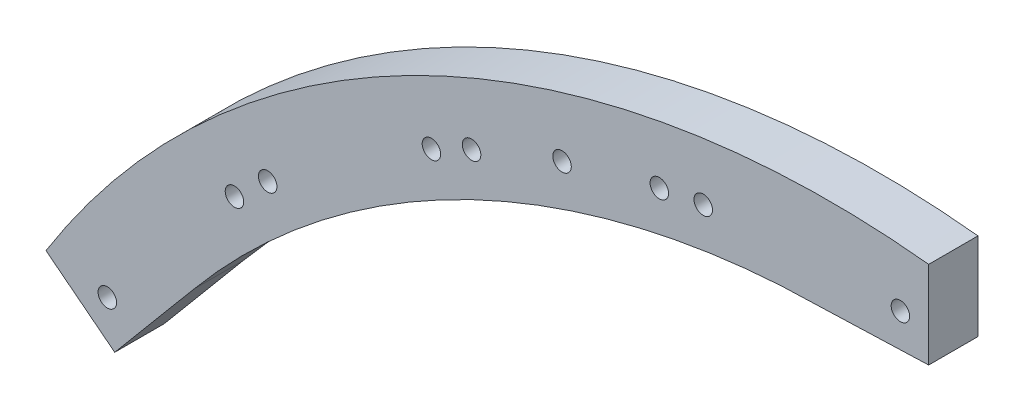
ISO-10303-21;
HEADER;
FILE_DESCRIPTION(('STEP AP214'),'2;1');
FILE_NAME('part.step','',(''),(''),'','','');
FILE_SCHEMA(('AUTOMOTIVE_DESIGN { 1 0 10303 214 1 1 1 1 }'));
ENDSEC;
DATA;
#1=APPLICATION_CONTEXT('core data for automotive mechanical design processes');
#2=APPLICATION_PROTOCOL_DEFINITION('international standard','automotive_design',2000,#1);
#3=PRODUCT_CONTEXT('',#1,'mechanical');
#4=PRODUCT('Part','Part','',(#3));
#5=PRODUCT_RELATED_PRODUCT_CATEGORY('part','',(#4));
#6=PRODUCT_DEFINITION_FORMATION('','',#4);
#7=PRODUCT_DEFINITION_CONTEXT('part definition',#1,'design');
#8=PRODUCT_DEFINITION('design','',#6,#7);
#9=PRODUCT_DEFINITION_SHAPE('','',#8);
#10=(LENGTH_UNIT() NAMED_UNIT(*) SI_UNIT(.MILLI.,.METRE.));
#11=(NAMED_UNIT(*) PLANE_ANGLE_UNIT() SI_UNIT($,.RADIAN.));
#12=(NAMED_UNIT(*) SI_UNIT($,.STERADIAN.) SOLID_ANGLE_UNIT());
#13=UNCERTAINTY_MEASURE_WITH_UNIT(LENGTH_MEASURE(1.E-05),#10,'distance_accuracy_value','');
#14=(GEOMETRIC_REPRESENTATION_CONTEXT(3) GLOBAL_UNCERTAINTY_ASSIGNED_CONTEXT((#13)) GLOBAL_UNIT_ASSIGNED_CONTEXT((#10,
#11,#12)) REPRESENTATION_CONTEXT('',''));
#15=CARTESIAN_POINT('',(0.,0.,0.));
#16=DIRECTION('',(0.,0.,1.));
#17=DIRECTION('',(1.,0.,0.));
#18=AXIS2_PLACEMENT_3D('',#15,#16,#17);
#19=CARTESIAN_POINT('',(-6.34135024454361,-53.5776344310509,3.175));
#20=DIRECTION('',(0.,0.,-1.));
#21=DIRECTION('',(-1.,0.,0.));
#22=AXIS2_PLACEMENT_3D('',#19,#20,#21);
#23=CYLINDRICAL_SURFACE('',#22,59.5312500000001);
#24=CARTESIAN_POINT('',(-6.34135024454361,-53.5776344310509,0.));
#25=DIRECTION('',(0.,0.,1.));
#26=DIRECTION('',(1.,0.,0.));
#27=AXIS2_PLACEMENT_3D('',#24,#25,#26);
#28=CIRCLE('',#27,59.5312500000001);
#29=CARTESIAN_POINT('',(1.34441069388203E-13,5.61490735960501,0.));
#30=VERTEX_POINT('',#29);
#31=CARTESIAN_POINT('',(-56.8286666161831,-22.0340041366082,0.));
#32=VERTEX_POINT('',#31);
#33=EDGE_CURVE('E121',#30,#32,#28,.T.);
#34=ORIENTED_EDGE('',*,*,#33,.T.);
#35=DIRECTION('',(0.,0.,-1.));
#36=VECTOR('',#35,1.);
#37=CARTESIAN_POINT('',(-56.8286666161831,-22.0340041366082,3.175));
#38=LINE('',#37,#36);
#39=CARTESIAN_POINT('',(-56.8286666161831,-22.0340041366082,3.175));
#40=VERTEX_POINT('',#39);
#41=EDGE_CURVE('E11',#40,#32,#38,.T.);
#42=ORIENTED_EDGE('',*,*,#41,.F.);
#43=CARTESIAN_POINT('',(-6.34135024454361,-53.5776344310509,3.175));
#44=DIRECTION('',(0.,0.,1.));
#45=DIRECTION('',(1.,0.,0.));
#46=AXIS2_PLACEMENT_3D('',#43,#44,#45);
#47=CIRCLE('',#46,59.5312500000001);
#48=CARTESIAN_POINT('',(1.34441069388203E-13,5.61490735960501,3.175));
#49=VERTEX_POINT('',#48);
#50=EDGE_CURVE('E132',#49,#40,#47,.T.);
#51=ORIENTED_EDGE('',*,*,#50,.F.);
#52=DIRECTION('',(0.,0.,-1.));
#53=VECTOR('',#52,1.);
#54=CARTESIAN_POINT('',(1.34441069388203E-13,5.61490735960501,3.175));
#55=LINE('',#54,#53);
#56=EDGE_CURVE('E117',#49,#30,#55,.T.);
#57=ORIENTED_EDGE('',*,*,#56,.T.);
#58=EDGE_LOOP('',(#34,#42,#51,#57));
#59=FACE_BOUND('',#58,.T.);
#60=ADVANCED_FACE('F37',(#59),#23,.T.);
#61=CARTESIAN_POINT('',(-56.8286666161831,-22.0340041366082,3.175));
#62=DIRECTION('',(0.615661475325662,0.788010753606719,0.));
#63=DIRECTION('',(-0.788010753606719,0.615661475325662,0.));
#64=AXIS2_PLACEMENT_3D('',#61,#62,#63);
#65=PLANE('',#64);
#66=DIRECTION('',(0.788010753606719,-0.615661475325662,0.));
#67=VECTOR('',#66,1.);
#68=CARTESIAN_POINT('',(-56.8286666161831,-22.0340041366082,0.));
#69=LINE('',#68,#67);
#70=CARTESIAN_POINT('',(-52.404059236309,-25.4908862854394,0.));
#71=VERTEX_POINT('',#70);
#72=EDGE_CURVE('E124',#32,#71,#69,.T.);
#73=ORIENTED_EDGE('',*,*,#72,.T.);
#74=DIRECTION('',(0.,0.,-1.));
#75=VECTOR('',#74,1.);
#76=CARTESIAN_POINT('',(-52.404059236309,-25.4908862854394,3.175));
#77=LINE('',#76,#75);
#78=CARTESIAN_POINT('',(-52.404059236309,-25.4908862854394,3.175));
#79=VERTEX_POINT('',#78);
#80=EDGE_CURVE('E45',#79,#71,#77,.T.);
#81=ORIENTED_EDGE('',*,*,#80,.F.);
#82=DIRECTION('',(0.788010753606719,-0.615661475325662,0.));
#83=VECTOR('',#82,1.);
#84=CARTESIAN_POINT('',(-56.8286666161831,-22.0340041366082,3.175));
#85=LINE('',#84,#83);
#86=EDGE_CURVE('E90',#40,#79,#85,.T.);
#87=ORIENTED_EDGE('',*,*,#86,.F.);
#88=ORIENTED_EDGE('',*,*,#41,.T.);
#89=EDGE_LOOP('',(#73,#81,#87,#88));
#90=FACE_BOUND('',#89,.T.);
#91=ADVANCED_FACE('F157',(#90),#65,.F.);
#92=CARTESIAN_POINT('',(-52.404059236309,-25.4908862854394,3.175));
#93=DIRECTION('',(-0.766044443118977,0.64278760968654,0.));
#94=DIRECTION('',(-0.64278760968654,-0.766044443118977,0.));
#95=AXIS2_PLACEMENT_3D('',#92,#93,#94);
#96=PLANE('',#95);
#97=DIRECTION('',(0.64278760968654,0.766044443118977,0.));
#98=VECTOR('',#97,1.);
#99=CARTESIAN_POINT('',(-52.404059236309,-25.4908862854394,0.));
#100=LINE('',#99,#98);
#101=CARTESIAN_POINT('',(-47.2988226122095,-19.4067021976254,0.));
#102=VERTEX_POINT('',#101);
#103=EDGE_CURVE('E127',#71,#102,#100,.T.);
#104=ORIENTED_EDGE('',*,*,#103,.T.);
#105=DIRECTION('',(0.,0.,-1.));
#106=VECTOR('',#105,1.);
#107=CARTESIAN_POINT('',(-47.2988226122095,-19.4067021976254,3.175));
#108=LINE('',#107,#106);
#109=CARTESIAN_POINT('',(-47.2988226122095,-19.4067021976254,3.175));
#110=VERTEX_POINT('',#109);
#111=EDGE_CURVE('E112',#110,#102,#108,.T.);
#112=ORIENTED_EDGE('',*,*,#111,.F.);
#113=DIRECTION('',(0.64278760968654,0.766044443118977,0.));
#114=VECTOR('',#113,1.);
#115=CARTESIAN_POINT('',(-52.404059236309,-25.4908862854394,3.175));
#116=LINE('',#115,#114);
#117=EDGE_CURVE('E103',#79,#110,#116,.T.);
#118=ORIENTED_EDGE('',*,*,#117,.F.);
#119=ORIENTED_EDGE('',*,*,#80,.T.);
#120=EDGE_LOOP('',(#104,#112,#118,#119));
#121=FACE_BOUND('',#120,.T.);
#122=ADVANCED_FACE('F138',(#121),#96,.F.);
#123=CARTESIAN_POINT('',(-6.34135024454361,-53.5776344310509,3.175));
#124=DIRECTION('',(0.,0.,-1.));
#125=DIRECTION('',(-1.,0.,0.));
#126=AXIS2_PLACEMENT_3D('',#123,#124,#125);
#127=CYLINDRICAL_SURFACE('',#126,53.3401082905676);
#128=CARTESIAN_POINT('',(-6.34135024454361,-53.5776344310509,0.));
#129=DIRECTION('',(0.,0.,-1.));
#130=DIRECTION('',(1.,0.,0.));
#131=AXIS2_PLACEMENT_3D('',#128,#129,#130);
#132=CIRCLE('',#131,53.3401082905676);
#133=CARTESIAN_POINT('',(-9.525,-0.332620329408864,0.));
#134=VERTEX_POINT('',#133);
#135=EDGE_CURVE('E111',#102,#134,#132,.T.);
#136=ORIENTED_EDGE('',*,*,#135,.T.);
#137=DIRECTION('',(0.,0.,-1.));
#138=VECTOR('',#137,1.);
#139=CARTESIAN_POINT('',(-9.525,-0.332620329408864,3.175));
#140=LINE('',#139,#138);
#141=CARTESIAN_POINT('',(-9.525,-0.332620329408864,3.175));
#142=VERTEX_POINT('',#141);
#143=EDGE_CURVE('E108',#142,#134,#140,.T.);
#144=ORIENTED_EDGE('',*,*,#143,.F.);
#145=CARTESIAN_POINT('',(-6.34135024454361,-53.5776344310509,3.175));
#146=DIRECTION('',(0.,0.,-1.));
#147=DIRECTION('',(1.,0.,0.));
#148=AXIS2_PLACEMENT_3D('',#145,#146,#147);
#149=CIRCLE('',#148,53.3401082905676);
#150=EDGE_CURVE('E97',#110,#142,#149,.T.);
#151=ORIENTED_EDGE('',*,*,#150,.F.);
#152=ORIENTED_EDGE('',*,*,#111,.T.);
#153=EDGE_LOOP('',(#136,#144,#151,#152));
#154=FACE_BOUND('',#153,.T.);
#155=ADVANCED_FACE('F109',(#154),#127,.F.);
#156=CARTESIAN_POINT('',(-9.525,-0.332620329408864,3.175));
#157=DIRECTION('',(-0.0348994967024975,0.999390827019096,0.));
#158=DIRECTION('',(-0.999390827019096,-0.0348994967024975,0.));
#159=AXIS2_PLACEMENT_3D('',#156,#157,#158);
#160=PLANE('',#159);
#161=DIRECTION('',(0.999390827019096,0.0348994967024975,0.));
#162=VECTOR('',#161,1.);
#163=CARTESIAN_POINT('',(-9.525,-0.332620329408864,0.));
#164=LINE('',#163,#162);
#165=CARTESIAN_POINT('',(0.,0.,0.));
#166=VERTEX_POINT('',#165);
#167=EDGE_CURVE('E76',#134,#166,#164,.T.);
#168=ORIENTED_EDGE('',*,*,#167,.T.);
#169=DIRECTION('',(0.,0.,-1.));
#170=VECTOR('',#169,1.);
#171=CARTESIAN_POINT('',(0.,0.,3.175));
#172=LINE('',#171,#170);
#173=CARTESIAN_POINT('',(0.,0.,3.175));
#174=VERTEX_POINT('',#173);
#175=EDGE_CURVE('E113',#174,#166,#172,.T.);
#176=ORIENTED_EDGE('',*,*,#175,.F.);
#177=DIRECTION('',(0.999390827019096,0.0348994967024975,0.));
#178=VECTOR('',#177,1.);
#179=CARTESIAN_POINT('',(-9.525,-0.332620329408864,3.175));
#180=LINE('',#179,#178);
#181=EDGE_CURVE('E101',#142,#174,#180,.T.);
#182=ORIENTED_EDGE('',*,*,#181,.F.);
#183=ORIENTED_EDGE('',*,*,#143,.T.);
#184=EDGE_LOOP('',(#168,#176,#182,#183));
#185=FACE_BOUND('',#184,.T.);
#186=ADVANCED_FACE('F115',(#185),#160,.F.);
#187=CARTESIAN_POINT('',(0.,0.,3.175));
#188=DIRECTION('',(-1.,0.,0.));
#189=DIRECTION('',(0.,-1.,0.));
#190=AXIS2_PLACEMENT_3D('',#187,#188,#189);
#191=PLANE('',#190);
#192=DIRECTION('',(0.,1.,0.));
#193=VECTOR('',#192,1.);
#194=CARTESIAN_POINT('',(0.,0.,0.));
#195=LINE('',#194,#193);
#196=EDGE_CURVE('E82',#166,#30,#195,.T.);
#197=ORIENTED_EDGE('',*,*,#196,.T.);
#198=ORIENTED_EDGE('',*,*,#56,.F.);
#199=DIRECTION('',(0.,1.,0.));
#200=VECTOR('',#199,1.);
#201=CARTESIAN_POINT('',(0.,0.,3.175));
#202=LINE('',#201,#200);
#203=EDGE_CURVE('E53',#174,#49,#202,.T.);
#204=ORIENTED_EDGE('',*,*,#203,.F.);
#205=ORIENTED_EDGE('',*,*,#175,.T.);
#206=EDGE_LOOP('',(#197,#198,#204,#205));
#207=FACE_BOUND('',#206,.T.);
#208=ADVANCED_FACE('F145',(#207),#191,.F.);
#209=CARTESIAN_POINT('',(-6.34135024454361,-53.5776344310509,3.175));
#210=DIRECTION('',(0.,0.,1.));
#211=DIRECTION('',(1.,0.,0.));
#212=AXIS2_PLACEMENT_3D('',#209,#210,#211);
#213=PLANE('',#212);
#214=CARTESIAN_POINT('',(-1.82101837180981,2.1004868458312,3.175));
#215=DIRECTION('',(0.,0.,1.));
#216=DIRECTION('',(1.,0.,0.));
#217=AXIS2_PLACEMENT_3D('',#214,#215,#216);
#218=CIRCLE('',#217,0.595629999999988);
#219=CARTESIAN_POINT('',(-1.22538837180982,2.1004868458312,3.175));
#220=VERTEX_POINT('',#219);
#221=EDGE_CURVE('E311',#220,#220,#218,.T.);
#222=ORIENTED_EDGE('',*,*,#221,.F.);
#223=EDGE_LOOP('',(#222));
#224=FACE_BOUND('',#223,.T.);
#225=CARTESIAN_POINT('',(-14.5142055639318,1.68455547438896,3.175));
#226=DIRECTION('',(0.,0.,1.));
#227=DIRECTION('',(1.,0.,0.));
#228=AXIS2_PLACEMENT_3D('',#225,#226,#227);
#229=CIRCLE('',#228,0.595629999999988);
#230=CARTESIAN_POINT('',(-13.9185755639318,1.68455547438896,3.175));
#231=VERTEX_POINT('',#230);
#232=EDGE_CURVE('E313',#231,#231,#229,.T.);
#233=ORIENTED_EDGE('',*,*,#232,.F.);
#234=EDGE_LOOP('',(#233));
#235=FACE_BOUND('',#234,.T.);
#236=CARTESIAN_POINT('',(-17.3431772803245,1.19200216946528,3.175));
#237=DIRECTION('',(0.,0.,1.));
#238=DIRECTION('',(1.,0.,0.));
#239=AXIS2_PLACEMENT_3D('',#236,#237,#238);
#240=CIRCLE('',#239,0.595629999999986);
#241=CARTESIAN_POINT('',(-16.7475472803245,1.19200216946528,3.175));
#242=VERTEX_POINT('',#241);
#243=EDGE_CURVE('E321',#242,#242,#240,.T.);
#244=ORIENTED_EDGE('',*,*,#243,.F.);
#245=EDGE_LOOP('',(#244));
#246=FACE_BOUND('',#245,.T.);
#247=CARTESIAN_POINT('',(-29.430006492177,-2.70653083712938,3.175));
#248=DIRECTION('',(0.,0.,1.));
#249=DIRECTION('',(1.,0.,0.));
#250=AXIS2_PLACEMENT_3D('',#247,#248,#249);
#251=CIRCLE('',#250,0.595629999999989);
#252=CARTESIAN_POINT('',(-28.834376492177,-2.70653083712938,3.175));
#253=VERTEX_POINT('',#252);
#254=EDGE_CURVE('E327',#253,#253,#251,.T.);
#255=ORIENTED_EDGE('',*,*,#254,.F.);
#256=EDGE_LOOP('',(#255));
#257=FACE_BOUND('',#256,.T.);
#258=CARTESIAN_POINT('',(-32.013622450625,-3.95977506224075,3.175));
#259=DIRECTION('',(0.,0.,1.));
#260=DIRECTION('',(1.,0.,0.));
#261=AXIS2_PLACEMENT_3D('',#258,#259,#260);
#262=CIRCLE('',#261,0.595629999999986);
#263=CARTESIAN_POINT('',(-31.417992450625,-3.95977506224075,3.175));
#264=VERTEX_POINT('',#263);
#265=EDGE_CURVE('E333',#264,#264,#262,.T.);
#266=ORIENTED_EDGE('',*,*,#265,.F.);
#267=EDGE_LOOP('',(#266));
#268=FACE_BOUND('',#267,.T.);
#269=CARTESIAN_POINT('',(-42.5576470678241,-11.0388671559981,3.175));
#270=DIRECTION('',(0.,0.,1.));
#271=DIRECTION('',(1.,0.,0.));
#272=AXIS2_PLACEMENT_3D('',#269,#270,#271);
#273=CIRCLE('',#272,0.595629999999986);
#274=CARTESIAN_POINT('',(-41.9620170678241,-11.0388671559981,3.175));
#275=VERTEX_POINT('',#274);
#276=EDGE_CURVE('E339',#275,#275,#273,.T.);
#277=ORIENTED_EDGE('',*,*,#276,.F.);
#278=EDGE_LOOP('',(#277));
#279=FACE_BOUND('',#278,.T.);
#280=CARTESIAN_POINT('',(-44.6957372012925,-12.9557038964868,3.175));
#281=DIRECTION('',(0.,0.,1.));
#282=DIRECTION('',(1.,0.,0.));
#283=AXIS2_PLACEMENT_3D('',#280,#281,#282);
#284=CIRCLE('',#283,0.595629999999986);
#285=CARTESIAN_POINT('',(-44.1001072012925,-12.9557038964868,3.175));
#286=VERTEX_POINT('',#285);
#287=EDGE_CURVE('E345',#286,#286,#284,.T.);
#288=ORIENTED_EDGE('',*,*,#287,.F.);
#289=EDGE_LOOP('',(#288));
#290=FACE_BOUND('',#289,.T.);
#291=CARTESIAN_POINT('',(-52.8800419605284,-22.6668910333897,3.175));
#292=DIRECTION('',(0.,0.,1.));
#293=DIRECTION('',(1.,0.,0.));
#294=AXIS2_PLACEMENT_3D('',#291,#292,#293);
#295=CIRCLE('',#294,0.595629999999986);
#296=CARTESIAN_POINT('',(-52.2844119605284,-22.6668910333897,3.175));
#297=VERTEX_POINT('',#296);
#298=EDGE_CURVE('E351',#297,#297,#295,.T.);
#299=ORIENTED_EDGE('',*,*,#298,.F.);
#300=EDGE_LOOP('',(#299));
#301=FACE_BOUND('',#300,.T.);
#302=CARTESIAN_POINT('',(-23.6047422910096,-0.446376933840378,3.175));
#303=DIRECTION('',(0.,0.,1.));
#304=DIRECTION('',(1.,0.,0.));
#305=AXIS2_PLACEMENT_3D('',#302,#303,#304);
#306=CIRCLE('',#305,0.595629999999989);
#307=CARTESIAN_POINT('',(-23.0091122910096,-0.446376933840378,3.175));
#308=VERTEX_POINT('',#307);
#309=EDGE_CURVE('E357',#308,#308,#306,.T.);
#310=ORIENTED_EDGE('',*,*,#309,.F.);
#311=EDGE_LOOP('',(#310));
#312=FACE_BOUND('',#311,.T.);
#313=ORIENTED_EDGE('',*,*,#50,.T.);
#314=ORIENTED_EDGE('',*,*,#86,.T.);
#315=ORIENTED_EDGE('',*,*,#117,.T.);
#316=ORIENTED_EDGE('',*,*,#150,.T.);
#317=ORIENTED_EDGE('',*,*,#181,.T.);
#318=ORIENTED_EDGE('',*,*,#203,.T.);
#319=EDGE_LOOP('',(#313,#314,#315,#316,#317,#318));
#320=FACE_BOUND('',#319,.T.);
#321=ADVANCED_FACE('F99',(#224,#235,#246,#257,#268,#279,#290,#301,#312,#320),#213,.T.);
#322=CARTESIAN_POINT('',(-6.34135024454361,-53.5776344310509,0.));
#323=DIRECTION('',(0.,0.,1.));
#324=DIRECTION('',(1.,0.,0.));
#325=AXIS2_PLACEMENT_3D('',#322,#323,#324);
#326=PLANE('',#325);
#327=CARTESIAN_POINT('',(-1.82101837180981,2.1004868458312,0.));
#328=DIRECTION('',(0.,0.,1.));
#329=DIRECTION('',(1.,0.,0.));
#330=AXIS2_PLACEMENT_3D('',#327,#328,#329);
#331=CIRCLE('',#330,0.595629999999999);
#332=CARTESIAN_POINT('',(-1.22538837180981,2.1004868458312,0.));
#333=VERTEX_POINT('',#332);
#334=EDGE_CURVE('E308',#333,#333,#331,.T.);
#335=ORIENTED_EDGE('',*,*,#334,.T.);
#336=EDGE_LOOP('',(#335));
#337=FACE_BOUND('',#336,.T.);
#338=CARTESIAN_POINT('',(-14.5142055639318,1.68455547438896,0.));
#339=DIRECTION('',(0.,0.,1.));
#340=DIRECTION('',(1.,0.,0.));
#341=AXIS2_PLACEMENT_3D('',#338,#339,#340);
#342=CIRCLE('',#341,0.59563);
#343=CARTESIAN_POINT('',(-13.9185755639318,1.68455547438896,0.));
#344=VERTEX_POINT('',#343);
#345=EDGE_CURVE('E318',#344,#344,#342,.T.);
#346=ORIENTED_EDGE('',*,*,#345,.T.);
#347=EDGE_LOOP('',(#346));
#348=FACE_BOUND('',#347,.T.);
#349=CARTESIAN_POINT('',(-17.3431772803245,1.19200216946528,0.));
#350=DIRECTION('',(0.,0.,1.));
#351=DIRECTION('',(1.,0.,0.));
#352=AXIS2_PLACEMENT_3D('',#349,#350,#351);
#353=CIRCLE('',#352,0.59563);
#354=CARTESIAN_POINT('',(-16.7475472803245,1.19200216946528,0.));
#355=VERTEX_POINT('',#354);
#356=EDGE_CURVE('E324',#355,#355,#353,.T.);
#357=ORIENTED_EDGE('',*,*,#356,.T.);
#358=EDGE_LOOP('',(#357));
#359=FACE_BOUND('',#358,.T.);
#360=CARTESIAN_POINT('',(-29.430006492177,-2.70653083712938,0.));
#361=DIRECTION('',(0.,0.,1.));
#362=DIRECTION('',(1.,0.,0.));
#363=AXIS2_PLACEMENT_3D('',#360,#361,#362);
#364=CIRCLE('',#363,0.59563);
#365=CARTESIAN_POINT('',(-28.834376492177,-2.70653083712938,0.));
#366=VERTEX_POINT('',#365);
#367=EDGE_CURVE('E330',#366,#366,#364,.T.);
#368=ORIENTED_EDGE('',*,*,#367,.T.);
#369=EDGE_LOOP('',(#368));
#370=FACE_BOUND('',#369,.T.);
#371=CARTESIAN_POINT('',(-32.013622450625,-3.95977506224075,0.));
#372=DIRECTION('',(0.,0.,1.));
#373=DIRECTION('',(1.,0.,0.));
#374=AXIS2_PLACEMENT_3D('',#371,#372,#373);
#375=CIRCLE('',#374,0.59563);
#376=CARTESIAN_POINT('',(-31.417992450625,-3.95977506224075,0.));
#377=VERTEX_POINT('',#376);
#378=EDGE_CURVE('E336',#377,#377,#375,.T.);
#379=ORIENTED_EDGE('',*,*,#378,.T.);
#380=EDGE_LOOP('',(#379));
#381=FACE_BOUND('',#380,.T.);
#382=CARTESIAN_POINT('',(-42.5576470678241,-11.0388671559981,0.));
#383=DIRECTION('',(0.,0.,1.));
#384=DIRECTION('',(1.,0.,0.));
#385=AXIS2_PLACEMENT_3D('',#382,#383,#384);
#386=CIRCLE('',#385,0.59563);
#387=CARTESIAN_POINT('',(-41.9620170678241,-11.0388671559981,0.));
#388=VERTEX_POINT('',#387);
#389=EDGE_CURVE('E342',#388,#388,#386,.T.);
#390=ORIENTED_EDGE('',*,*,#389,.T.);
#391=EDGE_LOOP('',(#390));
#392=FACE_BOUND('',#391,.T.);
#393=CARTESIAN_POINT('',(-44.6957372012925,-12.9557038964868,0.));
#394=DIRECTION('',(0.,0.,1.));
#395=DIRECTION('',(1.,0.,0.));
#396=AXIS2_PLACEMENT_3D('',#393,#394,#395);
#397=CIRCLE('',#396,0.59563);
#398=CARTESIAN_POINT('',(-44.1001072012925,-12.9557038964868,0.));
#399=VERTEX_POINT('',#398);
#400=EDGE_CURVE('E348',#399,#399,#397,.T.);
#401=ORIENTED_EDGE('',*,*,#400,.T.);
#402=EDGE_LOOP('',(#401));
#403=FACE_BOUND('',#402,.T.);
#404=CARTESIAN_POINT('',(-52.8800419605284,-22.6668910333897,0.));
#405=DIRECTION('',(0.,0.,1.));
#406=DIRECTION('',(1.,0.,0.));
#407=AXIS2_PLACEMENT_3D('',#404,#405,#406);
#408=CIRCLE('',#407,0.59563);
#409=CARTESIAN_POINT('',(-52.2844119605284,-22.6668910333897,0.));
#410=VERTEX_POINT('',#409);
#411=EDGE_CURVE('E354',#410,#410,#408,.T.);
#412=ORIENTED_EDGE('',*,*,#411,.T.);
#413=EDGE_LOOP('',(#412));
#414=FACE_BOUND('',#413,.T.);
#415=CARTESIAN_POINT('',(-23.6047422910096,-0.446376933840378,0.));
#416=DIRECTION('',(0.,0.,1.));
#417=DIRECTION('',(1.,0.,0.));
#418=AXIS2_PLACEMENT_3D('',#415,#416,#417);
#419=CIRCLE('',#418,0.59563);
#420=CARTESIAN_POINT('',(-23.0091122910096,-0.446376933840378,0.));
#421=VERTEX_POINT('',#420);
#422=EDGE_CURVE('E125',#421,#421,#419,.T.);
#423=ORIENTED_EDGE('',*,*,#422,.T.);
#424=EDGE_LOOP('',(#423));
#425=FACE_BOUND('',#424,.T.);
#426=ORIENTED_EDGE('',*,*,#33,.F.);
#427=ORIENTED_EDGE('',*,*,#196,.F.);
#428=ORIENTED_EDGE('',*,*,#167,.F.);
#429=ORIENTED_EDGE('',*,*,#135,.F.);
#430=ORIENTED_EDGE('',*,*,#103,.F.);
#431=ORIENTED_EDGE('',*,*,#72,.F.);
#432=EDGE_LOOP('',(#426,#427,#428,#429,#430,#431));
#433=FACE_BOUND('',#432,.T.);
#434=ADVANCED_FACE('F141',(#337,#348,#359,#370,#381,#392,#403,#414,#425,#433),#326,.F.);
#435=CARTESIAN_POINT('',(-23.6047422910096,-0.446376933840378,3.175));
#436=DIRECTION('',(0.,0.,1.));
#437=DIRECTION('',(1.,0.,0.));
#438=AXIS2_PLACEMENT_3D('',#435,#436,#437);
#439=CYLINDRICAL_SURFACE('',#438,0.595629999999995);
#440=ORIENTED_EDGE('',*,*,#422,.F.);
#441=EDGE_LOOP('',(#440));
#442=FACE_BOUND('',#441,.T.);
#443=ORIENTED_EDGE('',*,*,#309,.T.);
#444=EDGE_LOOP('',(#443));
#445=FACE_BOUND('',#444,.T.);
#446=ADVANCED_FACE('F194',(#442,#445),#439,.F.);
#447=CARTESIAN_POINT('',(-52.8800419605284,-22.6668910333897,3.175));
#448=DIRECTION('',(0.,0.,1.));
#449=DIRECTION('',(1.,0.,0.));
#450=AXIS2_PLACEMENT_3D('',#447,#448,#449);
#451=CYLINDRICAL_SURFACE('',#450,0.595629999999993);
#452=ORIENTED_EDGE('',*,*,#411,.F.);
#453=EDGE_LOOP('',(#452));
#454=FACE_BOUND('',#453,.T.);
#455=ORIENTED_EDGE('',*,*,#298,.T.);
#456=EDGE_LOOP('',(#455));
#457=FACE_BOUND('',#456,.T.);
#458=ADVANCED_FACE('F204',(#454,#457),#451,.F.);
#459=CARTESIAN_POINT('',(-44.6957372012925,-12.9557038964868,3.175));
#460=DIRECTION('',(0.,0.,1.));
#461=DIRECTION('',(1.,0.,0.));
#462=AXIS2_PLACEMENT_3D('',#459,#460,#461);
#463=CYLINDRICAL_SURFACE('',#462,0.595629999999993);
#464=ORIENTED_EDGE('',*,*,#400,.F.);
#465=EDGE_LOOP('',(#464));
#466=FACE_BOUND('',#465,.T.);
#467=ORIENTED_EDGE('',*,*,#287,.T.);
#468=EDGE_LOOP('',(#467));
#469=FACE_BOUND('',#468,.T.);
#470=ADVANCED_FACE('F216',(#466,#469),#463,.F.);
#471=CARTESIAN_POINT('',(-42.5576470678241,-11.0388671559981,3.175));
#472=DIRECTION('',(0.,0.,1.));
#473=DIRECTION('',(1.,0.,0.));
#474=AXIS2_PLACEMENT_3D('',#471,#472,#473);
#475=CYLINDRICAL_SURFACE('',#474,0.595629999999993);
#476=ORIENTED_EDGE('',*,*,#389,.F.);
#477=EDGE_LOOP('',(#476));
#478=FACE_BOUND('',#477,.T.);
#479=ORIENTED_EDGE('',*,*,#276,.T.);
#480=EDGE_LOOP('',(#479));
#481=FACE_BOUND('',#480,.T.);
#482=ADVANCED_FACE('F227',(#478,#481),#475,.F.);
#483=CARTESIAN_POINT('',(-32.013622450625,-3.95977506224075,3.175));
#484=DIRECTION('',(0.,0.,1.));
#485=DIRECTION('',(1.,0.,0.));
#486=AXIS2_PLACEMENT_3D('',#483,#484,#485);
#487=CYLINDRICAL_SURFACE('',#486,0.595629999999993);
#488=ORIENTED_EDGE('',*,*,#378,.F.);
#489=EDGE_LOOP('',(#488));
#490=FACE_BOUND('',#489,.T.);
#491=ORIENTED_EDGE('',*,*,#265,.T.);
#492=EDGE_LOOP('',(#491));
#493=FACE_BOUND('',#492,.T.);
#494=ADVANCED_FACE('F238',(#490,#493),#487,.F.);
#495=CARTESIAN_POINT('',(-29.430006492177,-2.70653083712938,3.175));
#496=DIRECTION('',(0.,0.,1.));
#497=DIRECTION('',(1.,0.,0.));
#498=AXIS2_PLACEMENT_3D('',#495,#496,#497);
#499=CYLINDRICAL_SURFACE('',#498,0.595629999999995);
#500=ORIENTED_EDGE('',*,*,#367,.F.);
#501=EDGE_LOOP('',(#500));
#502=FACE_BOUND('',#501,.T.);
#503=ORIENTED_EDGE('',*,*,#254,.T.);
#504=EDGE_LOOP('',(#503));
#505=FACE_BOUND('',#504,.T.);
#506=ADVANCED_FACE('F249',(#502,#505),#499,.F.);
#507=CARTESIAN_POINT('',(-17.3431772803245,1.19200216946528,3.175));
#508=DIRECTION('',(0.,0.,1.));
#509=DIRECTION('',(1.,0.,0.));
#510=AXIS2_PLACEMENT_3D('',#507,#508,#509);
#511=CYLINDRICAL_SURFACE('',#510,0.595629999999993);
#512=ORIENTED_EDGE('',*,*,#356,.F.);
#513=EDGE_LOOP('',(#512));
#514=FACE_BOUND('',#513,.T.);
#515=ORIENTED_EDGE('',*,*,#243,.T.);
#516=EDGE_LOOP('',(#515));
#517=FACE_BOUND('',#516,.T.);
#518=ADVANCED_FACE('F260',(#514,#517),#511,.F.);
#519=CARTESIAN_POINT('',(-14.5142055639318,1.68455547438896,3.175));
#520=DIRECTION('',(0.,0.,1.));
#521=DIRECTION('',(1.,0.,0.));
#522=AXIS2_PLACEMENT_3D('',#519,#520,#521);
#523=CYLINDRICAL_SURFACE('',#522,0.595629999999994);
#524=ORIENTED_EDGE('',*,*,#345,.F.);
#525=EDGE_LOOP('',(#524));
#526=FACE_BOUND('',#525,.T.);
#527=ORIENTED_EDGE('',*,*,#232,.T.);
#528=EDGE_LOOP('',(#527));
#529=FACE_BOUND('',#528,.T.);
#530=ADVANCED_FACE('F271',(#526,#529),#523,.F.);
#531=CARTESIAN_POINT('',(-1.82101837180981,2.1004868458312,3.175));
#532=DIRECTION('',(0.,0.,1.));
#533=DIRECTION('',(1.,0.,0.));
#534=AXIS2_PLACEMENT_3D('',#531,#532,#533);
#535=CYLINDRICAL_SURFACE('',#534,0.595629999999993);
#536=ORIENTED_EDGE('',*,*,#334,.F.);
#537=EDGE_LOOP('',(#536));
#538=FACE_BOUND('',#537,.T.);
#539=ORIENTED_EDGE('',*,*,#221,.T.);
#540=EDGE_LOOP('',(#539));
#541=FACE_BOUND('',#540,.T.);
#542=ADVANCED_FACE('F282',(#538,#541),#535,.F.);
#543=CLOSED_SHELL('',(#60,#91,#122,#155,#186,#208,#321,#434,#446,#458,#470,#482,#494,#506,#518,
#530,#542));
#544=MANIFOLD_SOLID_BREP('B2',#543);
#545=ADVANCED_BREP_SHAPE_REPRESENTATION('',(#18,#544),#14);
#546=SHAPE_DEFINITION_REPRESENTATION(#9,#545);
ENDSEC;
END-ISO-10303-21;
